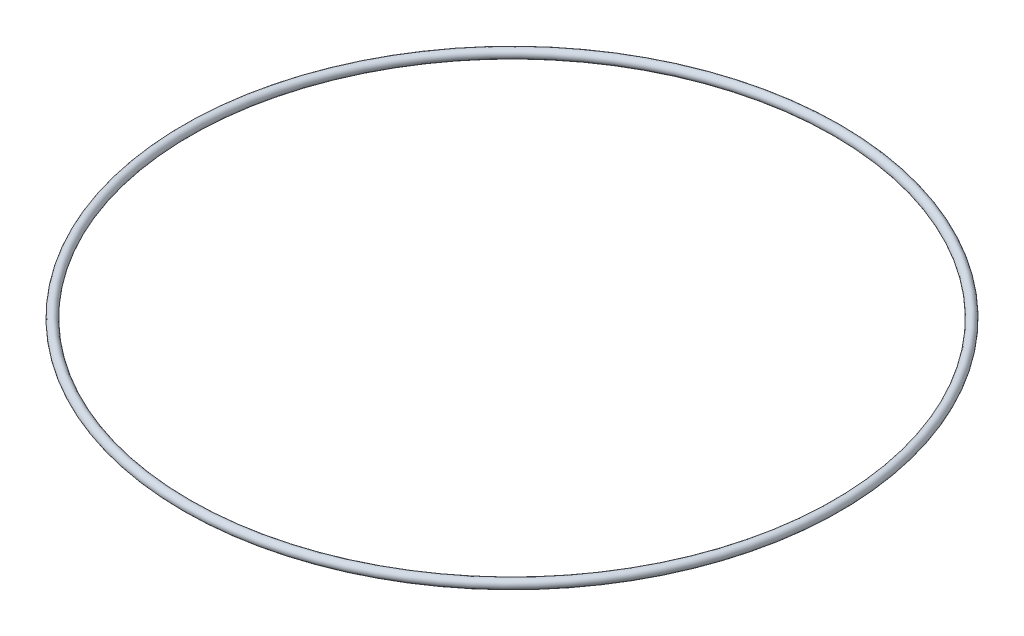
from build123d import *

# Parameters (mm, degrees)
ESQUISSE1_R = 1.5


with BuildPart() as part:
    # Esquisse1 → R_volution1 (revolve)
    with BuildSketch(Plane.XY, mode=Mode.PRIVATE) as r_volution1_sk:
        with Locations((108, 1.5)):
            Circle(ESQUISSE1_R)
    revolve(r_volution1_sk.sketch.rotate(Axis((0, 45.569153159, 0), (0, -1, 0)), 90), axis=Axis((0, 45.569153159, 0), (0, -1, 0)))


solid = part.part
